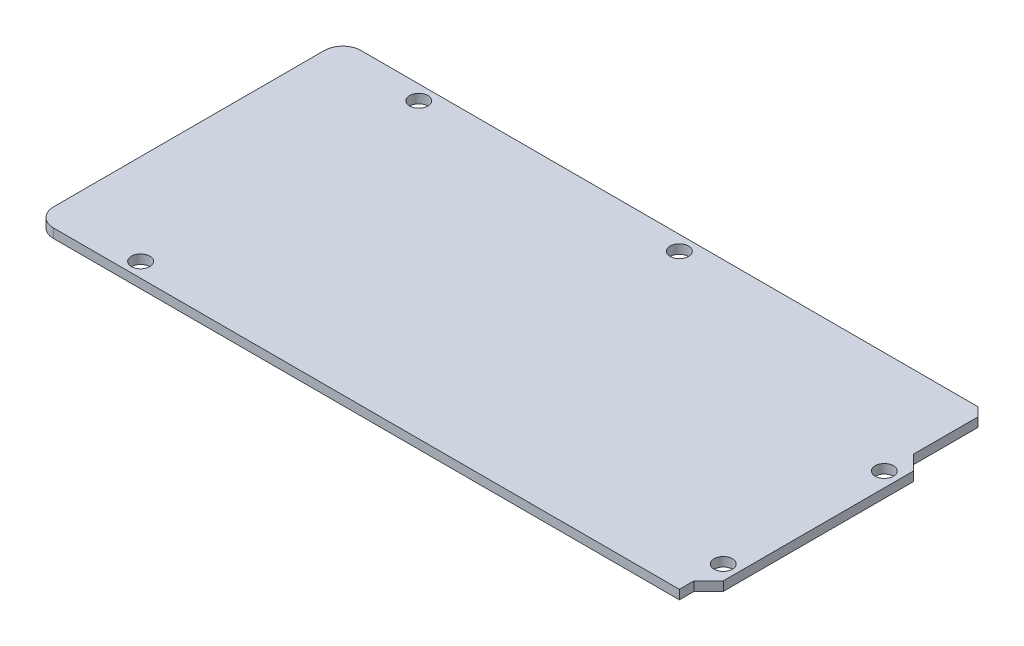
from build123d import *

# Parameters (mm, degrees)
BOSS_EXTRUDE1_DEPTH          = 1.5875
F_1_8_0_125_DIAMETER_HOLE1_D = 3.175


with BuildPart() as part:
    # Sketch1 → Boss-Extrude1 (new body)
    with BuildSketch(Plane(origin=(0, 0, 0), x_dir=(1, 0, 0), z_dir=(0, 1, 0))):
        with BuildLine():
            Line((111.76, 2.54), (114.3, 5.08))
            Line((114.3, 5.08), (114.3, 38.1))
            Line((114.3, 38.1), (111.76, 40.64))
            Line((111.76, 40.64), (111.76, 51.816))
            Line((111.76, 51.816), (110.236, 53.34))
            Line((110.236, 53.34), (3.175, 53.34))
            ThreePointArc((3.175, 53.34), (0.92993597, 52.41006403), (0, 50.165))
            Line((0, 50.165), (0, 3.175))
            ThreePointArc((0, 3.175), (0.92993597, 0.92993597), (3.175, 0))
            Line((3.175, 0), (111.76, 0))
            Line((111.76, 0), (111.76, 2.54))
        make_face()
    extrude(amount=BOSS_EXTRUDE1_DEPTH)

    # 1_8 _0.125_ Diameter Hole1 (through all)
    with Locations(Plane(origin=(15.748, 1.5875, -50.8), x_dir=(0, 0, 1), z_dir=(0, 1, 0))):
        with Locations((0, 0), (48.26, 0), (0, 45.212), (15.24, 96.012), (43.18, 96.012)):
            Hole(F_1_8_0_125_DIAMETER_HOLE1_D / 2)


solid = part.part
